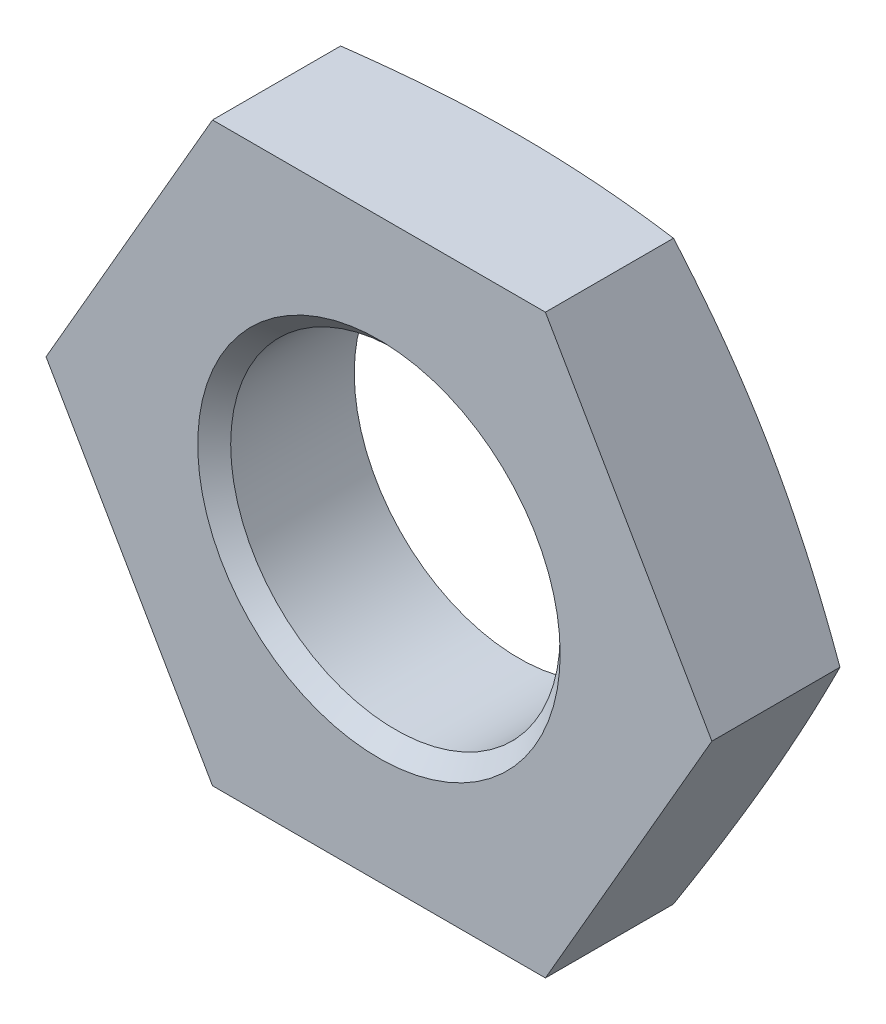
from build123d import *

# Parameters (mm, degrees)
SKETCH1_R     = 2
BASENUT_DEPTH = 1.7
CHAMFER1_SIZE = 0.2


with BuildPart() as part:
    # Sketch1 → BaseNut (new body)
    with BuildSketch(Plane.XY):
        Polygon((2.020725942, -3.5), (4.041451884, 0), (2.020725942, 3.5), (-2.020725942, 3.5), (-4.041451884, 0), (-2.020725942, -3.5), align=None)
        Circle(SKETCH1_R, mode=Mode.SUBTRACT)
    extrude(amount=-BASENUT_DEPTH)

    # Sketch2 → Double-Chamfer (revolve, cut)
    with BuildSketch(Plane(origin=(0, 0, 0), x_dir=(1, 0, 0), z_dir=(0, 1, 0))):
        Polygon((-4.041451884, 1.7), (-3.5, 1.7), (-4.041451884, 1.554918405), align=None)
    revolve(axis=Axis((0, 0, -3.375940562), (0, 0, 1)), mode=Mode.SUBTRACT)

    # Chamfer1
    chamfer1_edges = [part.edges().sort_by_distance(p)[0] for p in [
        (-2, 0, 0),
    ]]
    chamfer(chamfer1_edges, length=CHAMFER1_SIZE)


solid = part.part
